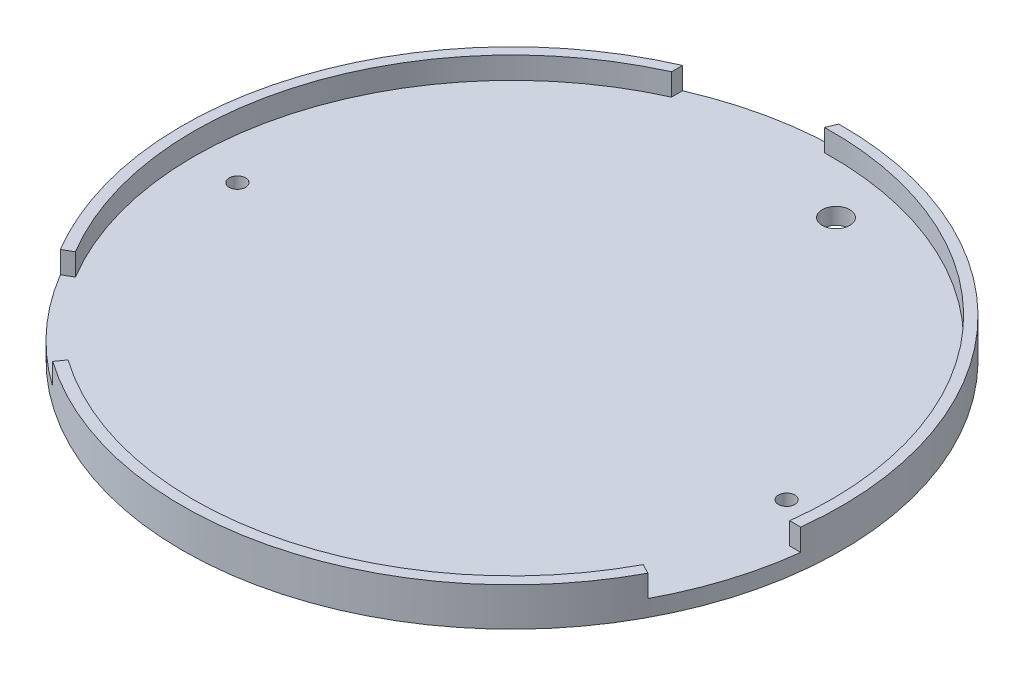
ISO-10303-21;
HEADER;
FILE_DESCRIPTION(('STEP AP214'),'2;1');
FILE_NAME('part.step','',(''),(''),'','','');
FILE_SCHEMA(('AUTOMOTIVE_DESIGN { 1 0 10303 214 1 1 1 1 }'));
ENDSEC;
DATA;
#1=APPLICATION_CONTEXT('core data for automotive mechanical design processes');
#2=APPLICATION_PROTOCOL_DEFINITION('international standard','automotive_design',2000,#1);
#3=PRODUCT_CONTEXT('',#1,'mechanical');
#4=PRODUCT('Part','Part','',(#3));
#5=PRODUCT_RELATED_PRODUCT_CATEGORY('part','',(#4));
#6=PRODUCT_DEFINITION_FORMATION('','',#4);
#7=PRODUCT_DEFINITION_CONTEXT('part definition',#1,'design');
#8=PRODUCT_DEFINITION('design','',#6,#7);
#9=PRODUCT_DEFINITION_SHAPE('','',#8);
#10=(LENGTH_UNIT() NAMED_UNIT(*) SI_UNIT(.MILLI.,.METRE.));
#11=(NAMED_UNIT(*) PLANE_ANGLE_UNIT() SI_UNIT($,.RADIAN.));
#12=(NAMED_UNIT(*) SI_UNIT($,.STERADIAN.) SOLID_ANGLE_UNIT());
#13=UNCERTAINTY_MEASURE_WITH_UNIT(LENGTH_MEASURE(1.E-05),#10,'distance_accuracy_value','');
#14=(GEOMETRIC_REPRESENTATION_CONTEXT(3) GLOBAL_UNCERTAINTY_ASSIGNED_CONTEXT((#13)) GLOBAL_UNIT_ASSIGNED_CONTEXT((#10,
#11,#12)) REPRESENTATION_CONTEXT('',''));
#15=CARTESIAN_POINT('',(0.,0.,0.));
#16=DIRECTION('',(0.,0.,1.));
#17=DIRECTION('',(1.,0.,0.));
#18=AXIS2_PLACEMENT_3D('',#15,#16,#17);
#19=CARTESIAN_POINT('',(0.,3.,0.));
#20=DIRECTION('',(0.,-1.,0.));
#21=DIRECTION('',(0.,0.,-1.));
#22=AXIS2_PLACEMENT_3D('',#19,#20,#21);
#23=CYLINDRICAL_SURFACE('',#22,60.);
#24=CARTESIAN_POINT('',(0.,0.,0.));
#25=DIRECTION('',(0.,1.,0.));
#26=DIRECTION('',(0.,0.,1.));
#27=AXIS2_PLACEMENT_3D('',#24,#25,#26);
#28=CIRCLE('',#27,60.);
#29=CARTESIAN_POINT('',(0.,0.,60.));
#30=VERTEX_POINT('',#29);
#31=EDGE_CURVE('E42',#30,#30,#28,.T.);
#32=ORIENTED_EDGE('',*,*,#31,.T.);
#33=EDGE_LOOP('',(#32));
#34=FACE_BOUND('',#33,.T.);
#35=CARTESIAN_POINT('',(0.,3.,0.));
#36=DIRECTION('',(0.,1.,0.));
#37=DIRECTION('',(0.,0.,1.));
#38=AXIS2_PLACEMENT_3D('',#35,#36,#37);
#39=CIRCLE('',#38,60.);
#40=CARTESIAN_POINT('',(-0.480244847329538,3.,-59.9980780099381));
#41=VERTEX_POINT('',#40);
#42=CARTESIAN_POINT('',(-23.9561735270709,3.,-55.0100149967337));
#43=VERTEX_POINT('',#42);
#44=EDGE_CURVE('E48',#41,#43,#39,.T.);
#45=ORIENTED_EDGE('',*,*,#44,.F.);
#46=DIRECTION('',(0.,-1.,0.));
#47=VECTOR('',#46,1.);
#48=CARTESIAN_POINT('',(-0.480244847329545,7.,-59.9980780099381));
#49=LINE('',#48,#47);
#50=CARTESIAN_POINT('',(-0.480244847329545,7.,-59.9980780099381));
#51=VERTEX_POINT('',#50);
#52=EDGE_CURVE('E152',#51,#41,#49,.T.);
#53=ORIENTED_EDGE('',*,*,#52,.F.);
#54=CARTESIAN_POINT('',(-1.66533453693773E-13,7.,1.2490009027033E-13));
#55=DIRECTION('',(0.,-1.,0.));
#56=DIRECTION('',(0.,0.,-1.));
#57=AXIS2_PLACEMENT_3D('',#54,#55,#56);
#58=CIRCLE('',#57,60.0000000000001);
#59=CARTESIAN_POINT('',(59.5875281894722,7.,7.02328158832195));
#60=VERTEX_POINT('',#59);
#61=EDGE_CURVE('E144',#51,#60,#58,.T.);
#62=ORIENTED_EDGE('',*,*,#61,.T.);
#63=DIRECTION('',(0.,-1.,0.));
#64=VECTOR('',#63,1.);
#65=CARTESIAN_POINT('',(59.5875281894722,7.,7.02328158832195));
#66=LINE('',#65,#64);
#67=CARTESIAN_POINT('',(59.5875281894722,3.,7.02328158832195));
#68=VERTEX_POINT('',#67);
#69=EDGE_CURVE('E127',#60,#68,#66,.T.);
#70=ORIENTED_EDGE('',*,*,#69,.T.);
#71=CARTESIAN_POINT('',(52.9490197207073,3.,28.220583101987));
#72=VERTEX_POINT('',#71);
#73=EDGE_CURVE('E11',#72,#68,#39,.T.);
#74=ORIENTED_EDGE('',*,*,#73,.F.);
#75=DIRECTION('',(0.,-1.,0.));
#76=VECTOR('',#75,1.);
#77=CARTESIAN_POINT('',(52.9490197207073,7.,28.2205831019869));
#78=LINE('',#77,#76);
#79=CARTESIAN_POINT('',(52.9490197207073,7.,28.2205831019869));
#80=VERTEX_POINT('',#79);
#81=EDGE_CURVE('E236',#80,#72,#78,.T.);
#82=ORIENTED_EDGE('',*,*,#81,.F.);
#83=CARTESIAN_POINT('',(0.,7.,-2.28983498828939E-13));
#84=DIRECTION('',(0.,-1.,0.));
#85=DIRECTION('',(0.,0.,-1.));
#86=AXIS2_PLACEMENT_3D('',#83,#84,#85);
#87=CIRCLE('',#86,60.0000000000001);
#88=CARTESIAN_POINT('',(-34.6178692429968,7.,49.006153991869));
#89=VERTEX_POINT('',#88);
#90=EDGE_CURVE('E219',#80,#89,#87,.T.);
#91=ORIENTED_EDGE('',*,*,#90,.T.);
#92=DIRECTION('',(0.,-1.,0.));
#93=VECTOR('',#92,1.);
#94=CARTESIAN_POINT('',(-34.6178692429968,7.,49.006153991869));
#95=LINE('',#94,#93);
#96=CARTESIAN_POINT('',(-34.6178692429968,3.,49.006153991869));
#97=VERTEX_POINT('',#96);
#98=EDGE_CURVE('E235',#89,#97,#95,.T.);
#99=ORIENTED_EDGE('',*,*,#98,.T.);
#100=CARTESIAN_POINT('',(-51.5840355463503,3.,30.6445309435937));
#101=VERTEX_POINT('',#100);
#102=EDGE_CURVE('E49',#101,#97,#39,.T.);
#103=ORIENTED_EDGE('',*,*,#102,.F.);
#104=DIRECTION('',(0.,-1.,0.));
#105=VECTOR('',#104,1.);
#106=CARTESIAN_POINT('',(-51.5840355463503,7.,30.6445309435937));
#107=LINE('',#106,#105);
#108=CARTESIAN_POINT('',(-51.5840355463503,7.,30.6445309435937));
#109=VERTEX_POINT('',#108);
#110=EDGE_CURVE('E192',#109,#101,#107,.T.);
#111=ORIENTED_EDGE('',*,*,#110,.F.);
#112=CARTESIAN_POINT('',(1.31838984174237E-13,7.,1.04083408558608E-13));
#113=DIRECTION('',(0.,-1.,0.));
#114=DIRECTION('',(0.,0.,1.));
#115=AXIS2_PLACEMENT_3D('',#112,#113,#114);
#116=CIRCLE('',#115,60.0000000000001);
#117=CARTESIAN_POINT('',(-23.9561735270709,7.,-55.0100149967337));
#118=VERTEX_POINT('',#117);
#119=EDGE_CURVE('E175',#109,#118,#116,.T.);
#120=ORIENTED_EDGE('',*,*,#119,.T.);
#121=DIRECTION('',(0.,-1.,0.));
#122=VECTOR('',#121,1.);
#123=CARTESIAN_POINT('',(-23.9561735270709,7.,-55.0100149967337));
#124=LINE('',#123,#122);
#125=EDGE_CURVE('E191',#118,#43,#124,.T.);
#126=ORIENTED_EDGE('',*,*,#125,.T.);
#127=EDGE_LOOP('',(#45,#53,#62,#70,#74,#82,#91,#99,#103,#111,#120,#126));
#128=FACE_BOUND('',#127,.T.);
#129=ADVANCED_FACE('F39',(#34,#128),#23,.T.);
#130=CARTESIAN_POINT('',(0.,3.,0.));
#131=DIRECTION('',(0.,1.,0.));
#132=DIRECTION('',(0.,0.,1.));
#133=AXIS2_PLACEMENT_3D('',#130,#131,#132);
#134=PLANE('',#133);
#135=DIRECTION('',(-0.390670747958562,0.,0.920530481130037));
#136=VECTOR('',#135,1.);
#137=CARTESIAN_POINT('',(-21.9837168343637,3.,-9.32983238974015));
#138=LINE('',#137,#136);
#139=CARTESIAN_POINT('',(-1.26158634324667,3.,-58.157017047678));
#140=VERTEX_POINT('',#139);
#141=EDGE_CURVE('E172',#41,#140,#138,.T.);
#142=ORIENTED_EDGE('',*,*,#141,.F.);
#143=ORIENTED_EDGE('',*,*,#44,.T.);
#144=DIRECTION('',(0.,0.,-1.));
#145=VECTOR('',#144,1.);
#146=CARTESIAN_POINT('',(-23.9561735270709,3.,0.));
#147=LINE('',#146,#145);
#148=CARTESIAN_POINT('',(-23.9561735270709,3.,-53.0100149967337));
#149=VERTEX_POINT('',#148);
#150=EDGE_CURVE('E196',#149,#43,#147,.T.);
#151=ORIENTED_EDGE('',*,*,#150,.F.);
#152=CARTESIAN_POINT('',(-0.0888788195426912,3.,-0.148381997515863));
#153=DIRECTION('',(0.,1.,0.));
#154=DIRECTION('',(0.,0.,1.));
#155=AXIS2_PLACEMENT_3D('',#152,#153,#154);
#156=CIRCLE('',#155,58.);
#157=CARTESIAN_POINT('',(-49.8482160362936,3.,29.6510871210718));
#158=VERTEX_POINT('',#157);
#159=EDGE_CURVE('E211',#158,#149,#156,.F.);
#160=ORIENTED_EDGE('',*,*,#159,.F.);
#161=DIRECTION('',(0.867909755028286,0.,-0.496721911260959));
#162=VECTOR('',#161,1.);
#163=CARTESIAN_POINT('',(0.483691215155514,3.,0.845141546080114));
#164=LINE('',#163,#162);
#165=EDGE_CURVE('E215',#101,#158,#164,.T.);
#166=ORIENTED_EDGE('',*,*,#165,.F.);
#167=ORIENTED_EDGE('',*,*,#102,.T.);
#168=DIRECTION('',(-0.576964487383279,0.,0.816769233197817));
#169=VECTOR('',#168,1.);
#170=CARTESIAN_POINT('',(0.,3.,0.));
#171=LINE('',#170,#169);
#172=CARTESIAN_POINT('',(-33.4639402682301,3.,47.3726155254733));
#173=VERTEX_POINT('',#172);
#174=EDGE_CURVE('E240',#173,#97,#171,.T.);
#175=ORIENTED_EDGE('',*,*,#174,.F.);
#176=CARTESIAN_POINT('',(0.,3.,0.));
#177=DIRECTION('',(0.,1.,0.));
#178=DIRECTION('',(0.,0.,1.));
#179=AXIS2_PLACEMENT_3D('',#176,#177,#178);
#180=CIRCLE('',#179,58.);
#181=CARTESIAN_POINT('',(51.1840523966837,3.,27.2798969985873));
#182=VERTEX_POINT('',#181);
#183=EDGE_CURVE('E255',#182,#173,#180,.F.);
#184=ORIENTED_EDGE('',*,*,#183,.F.);
#185=DIRECTION('',(-0.882483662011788,0.,-0.470343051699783));
#186=VECTOR('',#185,1.);
#187=CARTESIAN_POINT('',(0.,3.,0.));
#188=LINE('',#187,#186);
#189=EDGE_CURVE('E259',#72,#182,#188,.T.);
#190=ORIENTED_EDGE('',*,*,#189,.F.);
#191=ORIENTED_EDGE('',*,*,#73,.T.);
#192=DIRECTION('',(1.,0.,0.));
#193=VECTOR('',#192,1.);
#194=CARTESIAN_POINT('',(0.,3.,7.0232815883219));
#195=LINE('',#194,#193);
#196=CARTESIAN_POINT('',(57.5875281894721,3.,7.02328158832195));
#197=VERTEX_POINT('',#196);
#198=EDGE_CURVE('E60',#197,#68,#195,.T.);
#199=ORIENTED_EDGE('',*,*,#198,.F.);
#200=CARTESIAN_POINT('',(0.0355100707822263,3.,-0.171522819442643));
#201=DIRECTION('',(0.,1.,0.));
#202=DIRECTION('',(0.,0.,1.));
#203=AXIS2_PLACEMENT_3D('',#200,#201,#202);
#204=CIRCLE('',#203,58.);
#205=EDGE_CURVE('E56',#140,#197,#204,.F.);
#206=ORIENTED_EDGE('',*,*,#205,.F.);
#207=EDGE_LOOP('',(#142,#143,#151,#160,#166,#167,#175,#184,#190,#191,#199,#206));
#208=FACE_BOUND('',#207,.T.);
#209=CARTESIAN_POINT('',(50.,3.,0.));
#210=DIRECTION('',(0.,1.,0.));
#211=DIRECTION('',(0.,0.,1.));
#212=AXIS2_PLACEMENT_3D('',#209,#210,#211);
#213=CIRCLE('',#212,1.5);
#214=CARTESIAN_POINT('',(50.,3.,1.5));
#215=VERTEX_POINT('',#214);
#216=EDGE_CURVE('E264',#215,#215,#213,.T.);
#217=ORIENTED_EDGE('',*,*,#216,.F.);
#218=EDGE_LOOP('',(#217));
#219=FACE_BOUND('',#218,.T.);
#220=CARTESIAN_POINT('',(-50.,3.,0.));
#221=DIRECTION('',(0.,1.,0.));
#222=DIRECTION('',(0.,0.,1.));
#223=AXIS2_PLACEMENT_3D('',#220,#221,#222);
#224=CIRCLE('',#223,1.5);
#225=CARTESIAN_POINT('',(-50.,3.,1.5));
#226=VERTEX_POINT('',#225);
#227=EDGE_CURVE('E273',#226,#226,#224,.T.);
#228=ORIENTED_EDGE('',*,*,#227,.F.);
#229=EDGE_LOOP('',(#228));
#230=FACE_BOUND('',#229,.T.);
#231=CARTESIAN_POINT('',(9.99999999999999,3.,-48.9897948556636));
#232=DIRECTION('',(0.,1.,0.));
#233=DIRECTION('',(0.,0.,1.));
#234=AXIS2_PLACEMENT_3D('',#231,#232,#233);
#235=CIRCLE('',#234,2.5);
#236=CARTESIAN_POINT('',(9.99999999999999,3.,-46.4897948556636));
#237=VERTEX_POINT('',#236);
#238=EDGE_CURVE('E263',#237,#237,#235,.T.);
#239=ORIENTED_EDGE('',*,*,#238,.F.);
#240=EDGE_LOOP('',(#239));
#241=FACE_BOUND('',#240,.T.);
#242=ADVANCED_FACE('F293',(#208,#219,#230,#241),#134,.T.);
#243=CARTESIAN_POINT('',(0.,0.,0.));
#244=DIRECTION('',(0.,1.,0.));
#245=DIRECTION('',(0.,0.,1.));
#246=AXIS2_PLACEMENT_3D('',#243,#244,#245);
#247=PLANE('',#246);
#248=CARTESIAN_POINT('',(50.,0.,0.));
#249=DIRECTION('',(0.,1.,0.));
#250=DIRECTION('',(0.,0.,1.));
#251=AXIS2_PLACEMENT_3D('',#248,#249,#250);
#252=CIRCLE('',#251,1.5);
#253=CARTESIAN_POINT('',(50.,0.,1.5));
#254=VERTEX_POINT('',#253);
#255=EDGE_CURVE('E268',#254,#254,#252,.F.);
#256=ORIENTED_EDGE('',*,*,#255,.F.);
#257=EDGE_LOOP('',(#256));
#258=FACE_BOUND('',#257,.T.);
#259=CARTESIAN_POINT('',(-50.,0.,0.));
#260=DIRECTION('',(0.,1.,0.));
#261=DIRECTION('',(0.,0.,1.));
#262=AXIS2_PLACEMENT_3D('',#259,#260,#261);
#263=CIRCLE('',#262,1.5);
#264=CARTESIAN_POINT('',(-50.,0.,1.5));
#265=VERTEX_POINT('',#264);
#266=EDGE_CURVE('E269',#265,#265,#263,.F.);
#267=ORIENTED_EDGE('',*,*,#266,.F.);
#268=EDGE_LOOP('',(#267));
#269=FACE_BOUND('',#268,.T.);
#270=CARTESIAN_POINT('',(9.99999999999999,0.,-48.9897948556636));
#271=DIRECTION('',(0.,1.,0.));
#272=DIRECTION('',(0.,0.,1.));
#273=AXIS2_PLACEMENT_3D('',#270,#271,#272);
#274=CIRCLE('',#273,2.5);
#275=CARTESIAN_POINT('',(9.99999999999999,0.,-46.4897948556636));
#276=VERTEX_POINT('',#275);
#277=EDGE_CURVE('E277',#276,#276,#274,.F.);
#278=ORIENTED_EDGE('',*,*,#277,.F.);
#279=EDGE_LOOP('',(#278));
#280=FACE_BOUND('',#279,.T.);
#281=ORIENTED_EDGE('',*,*,#31,.F.);
#282=EDGE_LOOP('',(#281));
#283=FACE_BOUND('',#282,.T.);
#284=ADVANCED_FACE('F290',(#258,#269,#280,#283),#247,.F.);
#285=CARTESIAN_POINT('',(9.99999999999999,-0.00100000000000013,-48.9897948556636));
#286=DIRECTION('',(0.,1.,0.));
#287=DIRECTION('',(0.,0.,1.));
#288=AXIS2_PLACEMENT_3D('',#285,#286,#287);
#289=CYLINDRICAL_SURFACE('',#288,2.5);
#290=CARTESIAN_POINT('',(9.99999999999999,3.,-46.4897948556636));
#291=CARTESIAN_POINT('',(9.99999999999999,2.96875,-46.4897948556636));
#292=CARTESIAN_POINT('',(9.99999999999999,2.9375,-46.4897948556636));
#293=CARTESIAN_POINT('',(9.99999999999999,2.875,-46.4897948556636));
#294=CARTESIAN_POINT('',(9.99999999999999,2.84375,-46.4897948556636));
#295=CARTESIAN_POINT('',(9.99999999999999,2.78125,-46.4897948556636));
#296=CARTESIAN_POINT('',(9.99999999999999,2.75,-46.4897948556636));
#297=CARTESIAN_POINT('',(9.99999999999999,2.6875,-46.4897948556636));
#298=CARTESIAN_POINT('',(9.99999999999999,2.65625,-46.4897948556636));
#299=CARTESIAN_POINT('',(9.99999999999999,2.59375,-46.4897948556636));
#300=CARTESIAN_POINT('',(9.99999999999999,2.5625,-46.4897948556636));
#301=CARTESIAN_POINT('',(9.99999999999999,2.5,-46.4897948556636));
#302=CARTESIAN_POINT('',(9.99999999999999,2.46875,-46.4897948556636));
#303=CARTESIAN_POINT('',(9.99999999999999,2.40625,-46.4897948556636));
#304=CARTESIAN_POINT('',(9.99999999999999,2.375,-46.4897948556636));
#305=CARTESIAN_POINT('',(9.99999999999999,2.3125,-46.4897948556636));
#306=CARTESIAN_POINT('',(9.99999999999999,2.28125,-46.4897948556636));
#307=CARTESIAN_POINT('',(9.99999999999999,2.21875,-46.4897948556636));
#308=CARTESIAN_POINT('',(9.99999999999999,2.1875,-46.4897948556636));
#309=CARTESIAN_POINT('',(9.99999999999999,2.125,-46.4897948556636));
#310=CARTESIAN_POINT('',(9.99999999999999,2.09375,-46.4897948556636));
#311=CARTESIAN_POINT('',(9.99999999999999,2.03125,-46.4897948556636));
#312=CARTESIAN_POINT('',(9.99999999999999,2.,-46.4897948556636));
#313=CARTESIAN_POINT('',(9.99999999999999,1.9375,-46.4897948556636));
#314=CARTESIAN_POINT('',(9.99999999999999,1.90625,-46.4897948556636));
#315=CARTESIAN_POINT('',(9.99999999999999,1.84375,-46.4897948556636));
#316=CARTESIAN_POINT('',(9.99999999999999,1.8125,-46.4897948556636));
#317=CARTESIAN_POINT('',(9.99999999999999,1.75,-46.4897948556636));
#318=CARTESIAN_POINT('',(9.99999999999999,1.71875,-46.4897948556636));
#319=CARTESIAN_POINT('',(9.99999999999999,1.65625,-46.4897948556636));
#320=CARTESIAN_POINT('',(9.99999999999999,1.625,-46.4897948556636));
#321=CARTESIAN_POINT('',(9.99999999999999,1.5625,-46.4897948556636));
#322=CARTESIAN_POINT('',(9.99999999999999,1.53125,-46.4897948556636));
#323=CARTESIAN_POINT('',(9.99999999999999,1.46875,-46.4897948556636));
#324=CARTESIAN_POINT('',(9.99999999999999,1.4375,-46.4897948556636));
#325=CARTESIAN_POINT('',(9.99999999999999,1.375,-46.4897948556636));
#326=CARTESIAN_POINT('',(9.99999999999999,1.34375,-46.4897948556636));
#327=CARTESIAN_POINT('',(9.99999999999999,1.28125,-46.4897948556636));
#328=CARTESIAN_POINT('',(9.99999999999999,1.25,-46.4897948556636));
#329=CARTESIAN_POINT('',(9.99999999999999,1.1875,-46.4897948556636));
#330=CARTESIAN_POINT('',(9.99999999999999,1.15625,-46.4897948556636));
#331=CARTESIAN_POINT('',(9.99999999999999,1.09375,-46.4897948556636));
#332=CARTESIAN_POINT('',(9.99999999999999,1.0625,-46.4897948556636));
#333=CARTESIAN_POINT('',(9.99999999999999,1.,-46.4897948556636));
#334=CARTESIAN_POINT('',(9.99999999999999,0.96875,-46.4897948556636));
#335=CARTESIAN_POINT('',(9.99999999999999,0.90625,-46.4897948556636));
#336=CARTESIAN_POINT('',(9.99999999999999,0.875,-46.4897948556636));
#337=CARTESIAN_POINT('',(9.99999999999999,0.8125,-46.4897948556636));
#338=CARTESIAN_POINT('',(9.99999999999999,0.78125,-46.4897948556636));
#339=CARTESIAN_POINT('',(9.99999999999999,0.71875,-46.4897948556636));
#340=CARTESIAN_POINT('',(9.99999999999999,0.6875,-46.4897948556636));
#341=CARTESIAN_POINT('',(9.99999999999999,0.625,-46.4897948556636));
#342=CARTESIAN_POINT('',(9.99999999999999,0.59375,-46.4897948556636));
#343=CARTESIAN_POINT('',(9.99999999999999,0.53125,-46.4897948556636));
#344=CARTESIAN_POINT('',(9.99999999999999,0.5,-46.4897948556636));
#345=CARTESIAN_POINT('',(9.99999999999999,0.4375,-46.4897948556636));
#346=CARTESIAN_POINT('',(9.99999999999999,0.40625,-46.4897948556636));
#347=CARTESIAN_POINT('',(9.99999999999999,0.34375,-46.4897948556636));
#348=CARTESIAN_POINT('',(9.99999999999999,0.3125,-46.4897948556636));
#349=CARTESIAN_POINT('',(9.99999999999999,0.25,-46.4897948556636));
#350=CARTESIAN_POINT('',(9.99999999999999,0.21875,-46.4897948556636));
#351=CARTESIAN_POINT('',(9.99999999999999,0.15625,-46.4897948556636));
#352=CARTESIAN_POINT('',(9.99999999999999,0.125,-46.4897948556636));
#353=CARTESIAN_POINT('',(9.99999999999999,0.0625000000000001,-46.4897948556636));
#354=CARTESIAN_POINT('',(9.99999999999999,0.0312500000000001,-46.4897948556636));
#355=CARTESIAN_POINT('',(9.99999999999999,0.,-46.4897948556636));
#356=B_SPLINE_CURVE_WITH_KNOTS('',3,(#290,#291,#292,#293,#294,#295,#296,#297,#298,#299,#300,
#301,#302,#303,#304,#305,#306,#307,#308,#309,#310,#311,#312,#313,#314,#315,#316,#317,#318,#319,
#320,#321,#322,#323,#324,#325,#326,#327,#328,#329,#330,#331,#332,#333,#334,#335,#336,#337,#338,
#339,#340,#341,#342,#343,#344,#345,#346,#347,#348,#349,#350,#351,#352,#353,#354,#355),
.UNSPECIFIED.,.F.,.F.,(4,2,2,2,2,2,2,2,2,2,2,2,2,2,2,2,2,2,2,2,2,2,2,2,2,2,2,2,2,2,2,2,4),(0.,
0.0937500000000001,0.1875,0.28125,0.375,0.46875,0.5625,0.65625,0.75,0.84375,0.9375,1.03125,
1.125,1.21875,1.3125,1.40625,1.5,1.59375,1.6875,1.78125,1.875,1.96875,2.0625,2.15625,2.25,
2.34375,2.4375,2.53125,2.625,2.71875,2.8125,2.90625,3.),.UNSPECIFIED.);
#357=EDGE_CURVE('BSEAM288',#237,#276,#356,.T.);
#358=ORIENTED_EDGE('',*,*,#238,.T.);
#359=ORIENTED_EDGE('',*,*,#277,.T.);
#360=ORIENTED_EDGE('',*,*,#357,.T.);
#361=ORIENTED_EDGE('',*,*,#357,.F.);
#362=EDGE_LOOP('',(#358,#360,#359,#361));
#363=FACE_BOUND('',#362,.T.);
#364=ADVANCED_FACE('F288',(#363),#289,.F.);
#365=CARTESIAN_POINT('',(-50.,-0.00100000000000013,0.));
#366=DIRECTION('',(0.,1.,0.));
#367=DIRECTION('',(0.,0.,1.));
#368=AXIS2_PLACEMENT_3D('',#365,#366,#367);
#369=CYLINDRICAL_SURFACE('',#368,1.5);
#370=CARTESIAN_POINT('',(-50.,3.,1.5));
#371=CARTESIAN_POINT('',(-50.,2.96875,1.5));
#372=CARTESIAN_POINT('',(-50.,2.9375,1.5));
#373=CARTESIAN_POINT('',(-50.,2.875,1.5));
#374=CARTESIAN_POINT('',(-50.,2.84375,1.5));
#375=CARTESIAN_POINT('',(-50.,2.78125,1.5));
#376=CARTESIAN_POINT('',(-50.,2.75,1.5));
#377=CARTESIAN_POINT('',(-50.,2.6875,1.5));
#378=CARTESIAN_POINT('',(-50.,2.65625,1.5));
#379=CARTESIAN_POINT('',(-50.,2.59375,1.5));
#380=CARTESIAN_POINT('',(-50.,2.5625,1.5));
#381=CARTESIAN_POINT('',(-50.,2.5,1.5));
#382=CARTESIAN_POINT('',(-50.,2.46875,1.5));
#383=CARTESIAN_POINT('',(-50.,2.40625,1.5));
#384=CARTESIAN_POINT('',(-50.,2.375,1.5));
#385=CARTESIAN_POINT('',(-50.,2.3125,1.5));
#386=CARTESIAN_POINT('',(-50.,2.28125,1.5));
#387=CARTESIAN_POINT('',(-50.,2.21875,1.5));
#388=CARTESIAN_POINT('',(-50.,2.1875,1.5));
#389=CARTESIAN_POINT('',(-50.,2.125,1.5));
#390=CARTESIAN_POINT('',(-50.,2.09375,1.5));
#391=CARTESIAN_POINT('',(-50.,2.03125,1.5));
#392=CARTESIAN_POINT('',(-50.,2.,1.5));
#393=CARTESIAN_POINT('',(-50.,1.9375,1.5));
#394=CARTESIAN_POINT('',(-50.,1.90625,1.5));
#395=CARTESIAN_POINT('',(-50.,1.84375,1.5));
#396=CARTESIAN_POINT('',(-50.,1.8125,1.5));
#397=CARTESIAN_POINT('',(-50.,1.75,1.5));
#398=CARTESIAN_POINT('',(-50.,1.71875,1.5));
#399=CARTESIAN_POINT('',(-50.,1.65625,1.5));
#400=CARTESIAN_POINT('',(-50.,1.625,1.5));
#401=CARTESIAN_POINT('',(-50.,1.5625,1.5));
#402=CARTESIAN_POINT('',(-50.,1.53125,1.5));
#403=CARTESIAN_POINT('',(-50.,1.46875,1.5));
#404=CARTESIAN_POINT('',(-50.,1.4375,1.5));
#405=CARTESIAN_POINT('',(-50.,1.375,1.5));
#406=CARTESIAN_POINT('',(-50.,1.34375,1.5));
#407=CARTESIAN_POINT('',(-50.,1.28125,1.5));
#408=CARTESIAN_POINT('',(-50.,1.25,1.5));
#409=CARTESIAN_POINT('',(-50.,1.1875,1.5));
#410=CARTESIAN_POINT('',(-50.,1.15625,1.5));
#411=CARTESIAN_POINT('',(-50.,1.09375,1.5));
#412=CARTESIAN_POINT('',(-50.,1.0625,1.5));
#413=CARTESIAN_POINT('',(-50.,1.,1.5));
#414=CARTESIAN_POINT('',(-50.,0.96875,1.5));
#415=CARTESIAN_POINT('',(-50.,0.90625,1.5));
#416=CARTESIAN_POINT('',(-50.,0.875,1.5));
#417=CARTESIAN_POINT('',(-50.,0.8125,1.5));
#418=CARTESIAN_POINT('',(-50.,0.78125,1.5));
#419=CARTESIAN_POINT('',(-50.,0.71875,1.5));
#420=CARTESIAN_POINT('',(-50.,0.6875,1.5));
#421=CARTESIAN_POINT('',(-50.,0.625,1.5));
#422=CARTESIAN_POINT('',(-50.,0.59375,1.5));
#423=CARTESIAN_POINT('',(-50.,0.53125,1.5));
#424=CARTESIAN_POINT('',(-50.,0.5,1.5));
#425=CARTESIAN_POINT('',(-50.,0.4375,1.5));
#426=CARTESIAN_POINT('',(-50.,0.40625,1.5));
#427=CARTESIAN_POINT('',(-50.,0.34375,1.5));
#428=CARTESIAN_POINT('',(-50.,0.3125,1.5));
#429=CARTESIAN_POINT('',(-50.,0.25,1.5));
#430=CARTESIAN_POINT('',(-50.,0.21875,1.5));
#431=CARTESIAN_POINT('',(-50.,0.15625,1.5));
#432=CARTESIAN_POINT('',(-50.,0.125,1.5));
#433=CARTESIAN_POINT('',(-50.,0.0625000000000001,1.5));
#434=CARTESIAN_POINT('',(-50.,0.0312500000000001,1.5));
#435=CARTESIAN_POINT('',(-50.,0.,1.5));
#436=B_SPLINE_CURVE_WITH_KNOTS('',3,(#370,#371,#372,#373,#374,#375,#376,#377,#378,#379,#380,
#381,#382,#383,#384,#385,#386,#387,#388,#389,#390,#391,#392,#393,#394,#395,#396,#397,#398,#399,
#400,#401,#402,#403,#404,#405,#406,#407,#408,#409,#410,#411,#412,#413,#414,#415,#416,#417,#418,
#419,#420,#421,#422,#423,#424,#425,#426,#427,#428,#429,#430,#431,#432,#433,#434,#435),
.UNSPECIFIED.,.F.,.F.,(4,2,2,2,2,2,2,2,2,2,2,2,2,2,2,2,2,2,2,2,2,2,2,2,2,2,2,2,2,2,2,2,4),(0.,
0.0937500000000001,0.1875,0.28125,0.375,0.46875,0.5625,0.65625,0.75,0.84375,0.9375,1.03125,
1.125,1.21875,1.3125,1.40625,1.5,1.59375,1.6875,1.78125,1.875,1.96875,2.0625,2.15625,2.25,
2.34375,2.4375,2.53125,2.625,2.71875,2.8125,2.90625,3.),.UNSPECIFIED.);
#437=EDGE_CURVE('BSEAM335',#226,#265,#436,.T.);
#438=ORIENTED_EDGE('',*,*,#227,.T.);
#439=ORIENTED_EDGE('',*,*,#266,.T.);
#440=ORIENTED_EDGE('',*,*,#437,.T.);
#441=ORIENTED_EDGE('',*,*,#437,.F.);
#442=EDGE_LOOP('',(#438,#440,#439,#441));
#443=FACE_BOUND('',#442,.T.);
#444=ADVANCED_FACE('F335',(#443),#369,.F.);
#445=CARTESIAN_POINT('',(50.,-0.00100000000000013,0.));
#446=DIRECTION('',(0.,1.,0.));
#447=DIRECTION('',(0.,0.,1.));
#448=AXIS2_PLACEMENT_3D('',#445,#446,#447);
#449=CYLINDRICAL_SURFACE('',#448,1.5);
#450=CARTESIAN_POINT('',(50.,3.,1.5));
#451=CARTESIAN_POINT('',(50.,2.96875,1.5));
#452=CARTESIAN_POINT('',(50.,2.9375,1.5));
#453=CARTESIAN_POINT('',(50.,2.875,1.5));
#454=CARTESIAN_POINT('',(50.,2.84375,1.5));
#455=CARTESIAN_POINT('',(50.,2.78125,1.5));
#456=CARTESIAN_POINT('',(50.,2.75,1.5));
#457=CARTESIAN_POINT('',(50.,2.6875,1.5));
#458=CARTESIAN_POINT('',(50.,2.65625,1.5));
#459=CARTESIAN_POINT('',(50.,2.59375,1.5));
#460=CARTESIAN_POINT('',(50.,2.5625,1.5));
#461=CARTESIAN_POINT('',(50.,2.5,1.5));
#462=CARTESIAN_POINT('',(50.,2.46875,1.5));
#463=CARTESIAN_POINT('',(50.,2.40625,1.5));
#464=CARTESIAN_POINT('',(50.,2.375,1.5));
#465=CARTESIAN_POINT('',(50.,2.3125,1.5));
#466=CARTESIAN_POINT('',(50.,2.28125,1.5));
#467=CARTESIAN_POINT('',(50.,2.21875,1.5));
#468=CARTESIAN_POINT('',(50.,2.1875,1.5));
#469=CARTESIAN_POINT('',(50.,2.125,1.5));
#470=CARTESIAN_POINT('',(50.,2.09375,1.5));
#471=CARTESIAN_POINT('',(50.,2.03125,1.5));
#472=CARTESIAN_POINT('',(50.,2.,1.5));
#473=CARTESIAN_POINT('',(50.,1.9375,1.5));
#474=CARTESIAN_POINT('',(50.,1.90625,1.5));
#475=CARTESIAN_POINT('',(50.,1.84375,1.5));
#476=CARTESIAN_POINT('',(50.,1.8125,1.5));
#477=CARTESIAN_POINT('',(50.,1.75,1.5));
#478=CARTESIAN_POINT('',(50.,1.71875,1.5));
#479=CARTESIAN_POINT('',(50.,1.65625,1.5));
#480=CARTESIAN_POINT('',(50.,1.625,1.5));
#481=CARTESIAN_POINT('',(50.,1.5625,1.5));
#482=CARTESIAN_POINT('',(50.,1.53125,1.5));
#483=CARTESIAN_POINT('',(50.,1.46875,1.5));
#484=CARTESIAN_POINT('',(50.,1.4375,1.5));
#485=CARTESIAN_POINT('',(50.,1.375,1.5));
#486=CARTESIAN_POINT('',(50.,1.34375,1.5));
#487=CARTESIAN_POINT('',(50.,1.28125,1.5));
#488=CARTESIAN_POINT('',(50.,1.25,1.5));
#489=CARTESIAN_POINT('',(50.,1.1875,1.5));
#490=CARTESIAN_POINT('',(50.,1.15625,1.5));
#491=CARTESIAN_POINT('',(50.,1.09375,1.5));
#492=CARTESIAN_POINT('',(50.,1.0625,1.5));
#493=CARTESIAN_POINT('',(50.,1.,1.5));
#494=CARTESIAN_POINT('',(50.,0.96875,1.5));
#495=CARTESIAN_POINT('',(50.,0.90625,1.5));
#496=CARTESIAN_POINT('',(50.,0.875,1.5));
#497=CARTESIAN_POINT('',(50.,0.8125,1.5));
#498=CARTESIAN_POINT('',(50.,0.78125,1.5));
#499=CARTESIAN_POINT('',(50.,0.71875,1.5));
#500=CARTESIAN_POINT('',(50.,0.6875,1.5));
#501=CARTESIAN_POINT('',(50.,0.625,1.5));
#502=CARTESIAN_POINT('',(50.,0.59375,1.5));
#503=CARTESIAN_POINT('',(50.,0.53125,1.5));
#504=CARTESIAN_POINT('',(50.,0.5,1.5));
#505=CARTESIAN_POINT('',(50.,0.4375,1.5));
#506=CARTESIAN_POINT('',(50.,0.40625,1.5));
#507=CARTESIAN_POINT('',(50.,0.34375,1.5));
#508=CARTESIAN_POINT('',(50.,0.3125,1.5));
#509=CARTESIAN_POINT('',(50.,0.25,1.5));
#510=CARTESIAN_POINT('',(50.,0.21875,1.5));
#511=CARTESIAN_POINT('',(50.,0.15625,1.5));
#512=CARTESIAN_POINT('',(50.,0.125,1.5));
#513=CARTESIAN_POINT('',(50.,0.0625000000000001,1.5));
#514=CARTESIAN_POINT('',(50.,0.0312500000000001,1.5));
#515=CARTESIAN_POINT('',(50.,0.,1.5));
#516=B_SPLINE_CURVE_WITH_KNOTS('',3,(#450,#451,#452,#453,#454,#455,#456,#457,#458,#459,#460,
#461,#462,#463,#464,#465,#466,#467,#468,#469,#470,#471,#472,#473,#474,#475,#476,#477,#478,#479,
#480,#481,#482,#483,#484,#485,#486,#487,#488,#489,#490,#491,#492,#493,#494,#495,#496,#497,#498,
#499,#500,#501,#502,#503,#504,#505,#506,#507,#508,#509,#510,#511,#512,#513,#514,#515),
.UNSPECIFIED.,.F.,.F.,(4,2,2,2,2,2,2,2,2,2,2,2,2,2,2,2,2,2,2,2,2,2,2,2,2,2,2,2,2,2,2,2,4),(0.,
0.0937500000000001,0.1875,0.28125,0.375,0.46875,0.5625,0.65625,0.75,0.84375,0.9375,1.03125,
1.125,1.21875,1.3125,1.40625,1.5,1.59375,1.6875,1.78125,1.875,1.96875,2.0625,2.15625,2.25,
2.34375,2.4375,2.53125,2.625,2.71875,2.8125,2.90625,3.),.UNSPECIFIED.);
#517=EDGE_CURVE('BSEAM328',#215,#254,#516,.T.);
#518=ORIENTED_EDGE('',*,*,#216,.T.);
#519=ORIENTED_EDGE('',*,*,#255,.T.);
#520=ORIENTED_EDGE('',*,*,#517,.T.);
#521=ORIENTED_EDGE('',*,*,#517,.F.);
#522=EDGE_LOOP('',(#518,#520,#519,#521));
#523=FACE_BOUND('',#522,.T.);
#524=ADVANCED_FACE('F328',(#523),#449,.F.);
#525=CARTESIAN_POINT('',(52.9490197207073,7.,28.2205831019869));
#526=DIRECTION('',(0.470343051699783,0.,-0.882483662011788));
#527=DIRECTION('',(-0.882483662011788,0.,-0.470343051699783));
#528=AXIS2_PLACEMENT_3D('',#525,#526,#527);
#529=PLANE('',#528);
#530=ORIENTED_EDGE('',*,*,#81,.T.);
#531=ORIENTED_EDGE('',*,*,#189,.T.);
#532=DIRECTION('',(0.,-1.,0.));
#533=VECTOR('',#532,1.);
#534=CARTESIAN_POINT('',(51.1840523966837,7.,27.2798969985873));
#535=LINE('',#534,#533);
#536=CARTESIAN_POINT('',(51.1840523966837,7.,27.2798969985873));
#537=VERTEX_POINT('',#536);
#538=EDGE_CURVE('E241',#537,#182,#535,.T.);
#539=ORIENTED_EDGE('',*,*,#538,.F.);
#540=DIRECTION('',(0.882483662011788,0.,0.470343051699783));
#541=VECTOR('',#540,1.);
#542=CARTESIAN_POINT('',(52.9490197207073,7.,28.2205831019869));
#543=LINE('',#542,#541);
#544=EDGE_CURVE('E231',#537,#80,#543,.T.);
#545=ORIENTED_EDGE('',*,*,#544,.T.);
#546=EDGE_LOOP('',(#530,#531,#539,#545));
#547=FACE_BOUND('',#546,.T.);
#548=ADVANCED_FACE('F326',(#547),#529,.T.);
#549=CARTESIAN_POINT('',(0.,7.,0.));
#550=DIRECTION('',(0.,-1.,0.));
#551=DIRECTION('',(0.,0.,-1.));
#552=AXIS2_PLACEMENT_3D('',#549,#550,#551);
#553=CYLINDRICAL_SURFACE('',#552,58.);
#554=ORIENTED_EDGE('',*,*,#538,.T.);
#555=ORIENTED_EDGE('',*,*,#183,.T.);
#556=DIRECTION('',(0.,-1.,0.));
#557=VECTOR('',#556,1.);
#558=CARTESIAN_POINT('',(-33.4639402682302,7.,47.3726155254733));
#559=LINE('',#558,#557);
#560=CARTESIAN_POINT('',(-33.4639402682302,7.,47.3726155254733));
#561=VERTEX_POINT('',#560);
#562=EDGE_CURVE('E245',#561,#173,#559,.T.);
#563=ORIENTED_EDGE('',*,*,#562,.F.);
#564=CARTESIAN_POINT('',(0.,7.,0.));
#565=DIRECTION('',(0.,1.,0.));
#566=DIRECTION('',(0.,0.,1.));
#567=AXIS2_PLACEMENT_3D('',#564,#565,#566);
#568=CIRCLE('',#567,58.);
#569=EDGE_CURVE('E227',#561,#537,#568,.T.);
#570=ORIENTED_EDGE('',*,*,#569,.T.);
#571=EDGE_LOOP('',(#554,#555,#563,#570));
#572=FACE_BOUND('',#571,.T.);
#573=ADVANCED_FACE('F324',(#572),#553,.F.);
#574=CARTESIAN_POINT('',(-34.6178692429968,7.,49.006153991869));
#575=DIRECTION('',(-0.816769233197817,0.,-0.576964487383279));
#576=DIRECTION('',(-0.576964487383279,0.,0.816769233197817));
#577=AXIS2_PLACEMENT_3D('',#574,#575,#576);
#578=PLANE('',#577);
#579=ORIENTED_EDGE('',*,*,#562,.T.);
#580=ORIENTED_EDGE('',*,*,#174,.T.);
#581=ORIENTED_EDGE('',*,*,#98,.F.);
#582=DIRECTION('',(0.576964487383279,0.,-0.816769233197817));
#583=VECTOR('',#582,1.);
#584=CARTESIAN_POINT('',(-34.6178692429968,7.,49.006153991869));
#585=LINE('',#584,#583);
#586=EDGE_CURVE('E223',#89,#561,#585,.T.);
#587=ORIENTED_EDGE('',*,*,#586,.T.);
#588=EDGE_LOOP('',(#579,#580,#581,#587));
#589=FACE_BOUND('',#588,.T.);
#590=ADVANCED_FACE('F318',(#589),#578,.T.);
#591=CARTESIAN_POINT('',(0.,7.,-2.28983498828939E-13));
#592=DIRECTION('',(0.,-1.,0.));
#593=DIRECTION('',(0.,0.,-1.));
#594=AXIS2_PLACEMENT_3D('',#591,#592,#593);
#595=PLANE('',#594);
#596=ORIENTED_EDGE('',*,*,#90,.F.);
#597=ORIENTED_EDGE('',*,*,#544,.F.);
#598=ORIENTED_EDGE('',*,*,#569,.F.);
#599=ORIENTED_EDGE('',*,*,#586,.F.);
#600=EDGE_LOOP('',(#596,#597,#598,#599));
#601=FACE_BOUND('',#600,.T.);
#602=ADVANCED_FACE('F321',(#601),#595,.F.);
#603=CARTESIAN_POINT('',(-51.5840355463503,7.,30.6445309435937));
#604=DIRECTION('',(0.496721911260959,0.,0.867909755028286));
#605=DIRECTION('',(0.867909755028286,0.,-0.496721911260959));
#606=AXIS2_PLACEMENT_3D('',#603,#604,#605);
#607=PLANE('',#606);
#608=ORIENTED_EDGE('',*,*,#110,.T.);
#609=ORIENTED_EDGE('',*,*,#165,.T.);
#610=DIRECTION('',(0.,-1.,0.));
#611=VECTOR('',#610,1.);
#612=CARTESIAN_POINT('',(-49.8482160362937,7.,29.6510871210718));
#613=LINE('',#612,#611);
#614=CARTESIAN_POINT('',(-49.8482160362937,7.,29.6510871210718));
#615=VERTEX_POINT('',#614);
#616=EDGE_CURVE('E197',#615,#158,#613,.T.);
#617=ORIENTED_EDGE('',*,*,#616,.F.);
#618=DIRECTION('',(-0.867909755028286,0.,0.496721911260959));
#619=VECTOR('',#618,1.);
#620=CARTESIAN_POINT('',(-51.5840355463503,7.,30.6445309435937));
#621=LINE('',#620,#619);
#622=EDGE_CURVE('E187',#615,#109,#621,.T.);
#623=ORIENTED_EDGE('',*,*,#622,.T.);
#624=EDGE_LOOP('',(#608,#609,#617,#623));
#625=FACE_BOUND('',#624,.T.);
#626=ADVANCED_FACE('F312',(#625),#607,.T.);
#627=CARTESIAN_POINT('',(-0.0888788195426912,7.,-0.148381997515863));
#628=DIRECTION('',(0.,-1.,0.));
#629=DIRECTION('',(0.,0.,-1.));
#630=AXIS2_PLACEMENT_3D('',#627,#628,#629);
#631=CYLINDRICAL_SURFACE('',#630,58.);
#632=ORIENTED_EDGE('',*,*,#616,.T.);
#633=ORIENTED_EDGE('',*,*,#159,.T.);
#634=DIRECTION('',(0.,-1.,0.));
#635=VECTOR('',#634,1.);
#636=CARTESIAN_POINT('',(-23.9561735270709,7.,-53.0100149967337));
#637=LINE('',#636,#635);
#638=CARTESIAN_POINT('',(-23.9561735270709,7.,-53.0100149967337));
#639=VERTEX_POINT('',#638);
#640=EDGE_CURVE('E201',#639,#149,#637,.T.);
#641=ORIENTED_EDGE('',*,*,#640,.F.);
#642=CARTESIAN_POINT('',(-0.0888788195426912,7.,-0.148381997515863));
#643=DIRECTION('',(0.,1.,0.));
#644=DIRECTION('',(0.,0.,-1.));
#645=AXIS2_PLACEMENT_3D('',#642,#643,#644);
#646=CIRCLE('',#645,58.);
#647=EDGE_CURVE('E183',#639,#615,#646,.T.);
#648=ORIENTED_EDGE('',*,*,#647,.T.);
#649=EDGE_LOOP('',(#632,#633,#641,#648));
#650=FACE_BOUND('',#649,.T.);
#651=ADVANCED_FACE('F314',(#650),#631,.F.);
#652=CARTESIAN_POINT('',(-23.9561735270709,7.,-55.0100149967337));
#653=DIRECTION('',(1.,0.,0.));
#654=DIRECTION('',(0.,0.,-1.));
#655=AXIS2_PLACEMENT_3D('',#652,#653,#654);
#656=PLANE('',#655);
#657=ORIENTED_EDGE('',*,*,#640,.T.);
#658=ORIENTED_EDGE('',*,*,#150,.T.);
#659=ORIENTED_EDGE('',*,*,#125,.F.);
#660=DIRECTION('',(0.,0.,1.));
#661=VECTOR('',#660,1.);
#662=CARTESIAN_POINT('',(-23.9561735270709,7.,-55.0100149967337));
#663=LINE('',#662,#661);
#664=EDGE_CURVE('E179',#118,#639,#663,.T.);
#665=ORIENTED_EDGE('',*,*,#664,.T.);
#666=EDGE_LOOP('',(#657,#658,#659,#665));
#667=FACE_BOUND('',#666,.T.);
#668=ADVANCED_FACE('F304',(#667),#656,.T.);
#669=CARTESIAN_POINT('',(1.31838984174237E-13,7.,1.04083408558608E-13));
#670=DIRECTION('',(0.,1.,0.));
#671=DIRECTION('',(0.,0.,1.));
#672=AXIS2_PLACEMENT_3D('',#669,#670,#671);
#673=PLANE('',#672);
#674=ORIENTED_EDGE('',*,*,#119,.F.);
#675=ORIENTED_EDGE('',*,*,#622,.F.);
#676=ORIENTED_EDGE('',*,*,#647,.F.);
#677=ORIENTED_EDGE('',*,*,#664,.F.);
#678=EDGE_LOOP('',(#674,#675,#676,#677));
#679=FACE_BOUND('',#678,.T.);
#680=ADVANCED_FACE('F309',(#679),#673,.T.);
#681=CARTESIAN_POINT('',(-0.480244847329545,7.,-59.9980780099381));
#682=DIRECTION('',(-0.920530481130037,0.,-0.390670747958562));
#683=DIRECTION('',(-0.390670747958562,0.,0.920530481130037));
#684=AXIS2_PLACEMENT_3D('',#681,#682,#683);
#685=PLANE('',#684);
#686=ORIENTED_EDGE('',*,*,#52,.T.);
#687=ORIENTED_EDGE('',*,*,#141,.T.);
#688=DIRECTION('',(0.,-1.,0.));
#689=VECTOR('',#688,1.);
#690=CARTESIAN_POINT('',(-1.26158634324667,7.,-58.157017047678));
#691=LINE('',#690,#689);
#692=CARTESIAN_POINT('',(-1.26158634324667,7.,-58.157017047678));
#693=VERTEX_POINT('',#692);
#694=EDGE_CURVE('E162',#693,#140,#691,.T.);
#695=ORIENTED_EDGE('',*,*,#694,.F.);
#696=DIRECTION('',(0.390670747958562,0.,-0.920530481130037));
#697=VECTOR('',#696,1.);
#698=CARTESIAN_POINT('',(-0.480244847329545,7.,-59.9980780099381));
#699=LINE('',#698,#697);
#700=EDGE_CURVE('E137',#693,#51,#699,.T.);
#701=ORIENTED_EDGE('',*,*,#700,.T.);
#702=EDGE_LOOP('',(#686,#687,#695,#701));
#703=FACE_BOUND('',#702,.T.);
#704=ADVANCED_FACE('F368',(#703),#685,.T.);
#705=CARTESIAN_POINT('',(0.0355100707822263,7.,-0.171522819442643));
#706=DIRECTION('',(0.,-1.,0.));
#707=DIRECTION('',(0.,0.,-1.));
#708=AXIS2_PLACEMENT_3D('',#705,#706,#707);
#709=CYLINDRICAL_SURFACE('',#708,58.);
#710=ORIENTED_EDGE('',*,*,#694,.T.);
#711=ORIENTED_EDGE('',*,*,#205,.T.);
#712=DIRECTION('',(0.,-1.,0.));
#713=VECTOR('',#712,1.);
#714=CARTESIAN_POINT('',(57.5875281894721,7.,7.02328158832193));
#715=LINE('',#714,#713);
#716=CARTESIAN_POINT('',(57.5875281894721,7.,7.02328158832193));
#717=VERTEX_POINT('',#716);
#718=EDGE_CURVE('E136',#717,#197,#715,.T.);
#719=ORIENTED_EDGE('',*,*,#718,.F.);
#720=CARTESIAN_POINT('',(0.0355100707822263,7.,-0.171522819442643));
#721=DIRECTION('',(0.,1.,0.));
#722=DIRECTION('',(0.,0.,-1.));
#723=AXIS2_PLACEMENT_3D('',#720,#721,#722);
#724=CIRCLE('',#723,58.);
#725=EDGE_CURVE('E147',#717,#693,#724,.T.);
#726=ORIENTED_EDGE('',*,*,#725,.T.);
#727=EDGE_LOOP('',(#710,#711,#719,#726));
#728=FACE_BOUND('',#727,.T.);
#729=ADVANCED_FACE('F371',(#728),#709,.F.);
#730=CARTESIAN_POINT('',(59.5875281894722,7.,7.02328158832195));
#731=DIRECTION('',(0.,0.,1.));
#732=DIRECTION('',(1.,0.,0.));
#733=AXIS2_PLACEMENT_3D('',#730,#731,#732);
#734=PLANE('',#733);
#735=ORIENTED_EDGE('',*,*,#718,.T.);
#736=ORIENTED_EDGE('',*,*,#198,.T.);
#737=ORIENTED_EDGE('',*,*,#69,.F.);
#738=DIRECTION('',(-1.,0.,0.));
#739=VECTOR('',#738,1.);
#740=CARTESIAN_POINT('',(59.5875281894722,7.,7.02328158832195));
#741=LINE('',#740,#739);
#742=EDGE_CURVE('E131',#60,#717,#741,.T.);
#743=ORIENTED_EDGE('',*,*,#742,.T.);
#744=EDGE_LOOP('',(#735,#736,#737,#743));
#745=FACE_BOUND('',#744,.T.);
#746=ADVANCED_FACE('F130',(#745),#734,.T.);
#747=CARTESIAN_POINT('',(-1.66533453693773E-13,7.,1.2490009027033E-13));
#748=DIRECTION('',(0.,-1.,0.));
#749=DIRECTION('',(0.,0.,-1.));
#750=AXIS2_PLACEMENT_3D('',#747,#748,#749);
#751=PLANE('',#750);
#752=ORIENTED_EDGE('',*,*,#61,.F.);
#753=ORIENTED_EDGE('',*,*,#700,.F.);
#754=ORIENTED_EDGE('',*,*,#725,.F.);
#755=ORIENTED_EDGE('',*,*,#742,.F.);
#756=EDGE_LOOP('',(#752,#753,#754,#755));
#757=FACE_BOUND('',#756,.T.);
#758=ADVANCED_FACE('F142',(#757),#751,.F.);
#759=CLOSED_SHELL('',(#129,#242,#284,#364,#444,#524,#548,#573,#590,#602,#626,#651,#668,#680,
#704,#729,#746,#758));
#760=MANIFOLD_SOLID_BREP('B2',#759);
#761=ADVANCED_BREP_SHAPE_REPRESENTATION('',(#18,#760),#14);
#762=SHAPE_DEFINITION_REPRESENTATION(#9,#761);
ENDSEC;
END-ISO-10303-21;
